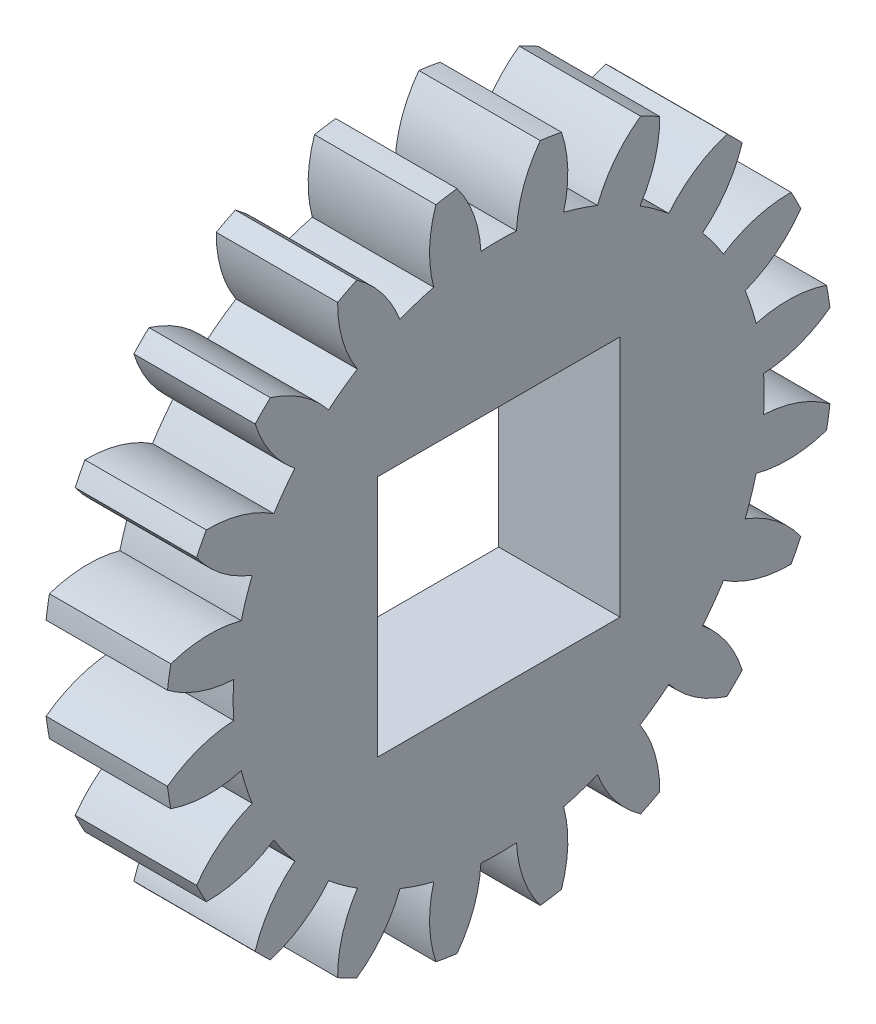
from build123d import *

# Parameters (mm, degrees)
BASPROSKE_W        = 6.35
BASPROSKE_H        = 17.4625
TOOTHCUT_DEPTH     = 26.499025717
TEETHCUTS_COUNT    = 20
TEETHCUTS_ANGLE    = 342
BORSKE_R           = 3.175
BORE_DEPTH         = 50.8000508
SKETCH1_W          = 12.7
SKETCH1_H          = 12.7
CUT_EXTRUDE1_DEPTH = 9.144
SCALE1_SCALE       = 0.5


with BuildPart() as part:
    # BasProSke → Base-Revolve (revolve)
    with BuildSketch(Plane(origin=(0, 0, 0), x_dir=(1, 0, 0), z_dir=(0, 1, 0)), mode=Mode.PRIVATE) as base_revolve_sk:
        with Locations((3.175, 8.73125)):
            Rectangle(BASPROSKE_W, BASPROSKE_H)
    revolve(base_revolve_sk.sketch.rotate(Axis((-10, 0, 0), (1, 0, 0)), 180), axis=Axis((-10, 0, 0), (1, 0, 0)))

    # TooCutSke → ToothCut (cut, through all)
    with BuildSketch(Plane(origin=(0, 0, 0), x_dir=(0, 0, -1), z_dir=(1, 0, 0))):
        with BuildLine():
            ThreePointArc((0.930751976, 13.858134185), (0, 13.889355), (-0.930751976, 13.858134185))
            ThreePointArc((-0.930751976, 13.858134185), (-1.300917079, 15.698306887), (-2.192883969, 17.349867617))
            ThreePointArc((-2.192883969, 17.349867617), (0, 17.4879), (2.192883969, 17.349867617))
            ThreePointArc((2.192883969, 17.349867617), (1.300917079, 15.698306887), (0.930751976, 13.858134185))
        make_face()
    toothcut = extrude(amount=TOOTHCUT_DEPTH, mode=Mode.SUBTRACT)

    # TeethCuts: ToothCut ×20 about axis
    teethcuts_axis = Axis((-10, 0, 0), (1, 0, 0))
    for i in range(1, TEETHCUTS_COUNT):
        add(toothcut.rotate(teethcuts_axis, i * TEETHCUTS_ANGLE / (TEETHCUTS_COUNT - 1)), mode=Mode.SUBTRACT)

    # BorSke → Bore (cut, symmetric)
    with BuildSketch(Plane(origin=(0, 0, 0), x_dir=(0, 0, -1), z_dir=(1, 0, 0))):
        with Locations(Location((0, 0, 0), (0, 0, 180))):
            Circle(BORSKE_R)
    extrude(amount=BORE_DEPTH, both=True, mode=Mode.SUBTRACT)

    # Sketch1 → Cut-Extrude1 (cut)
    with BuildSketch(Plane(origin=(0, 0, 0), x_dir=(0, 0, -1), z_dir=(1, 0, 0))):
        Rectangle(SKETCH1_W, SKETCH1_H)
    extrude(amount=CUT_EXTRUDE1_DEPTH, mode=Mode.SUBTRACT)


with BuildPart() as part_1:
    # Scale1: scaled about (3.175, 0, 0)
    add(part.part.scale(SCALE1_SCALE).moved(Location((1.5875, 0, 0))))


solid = part_1.part
